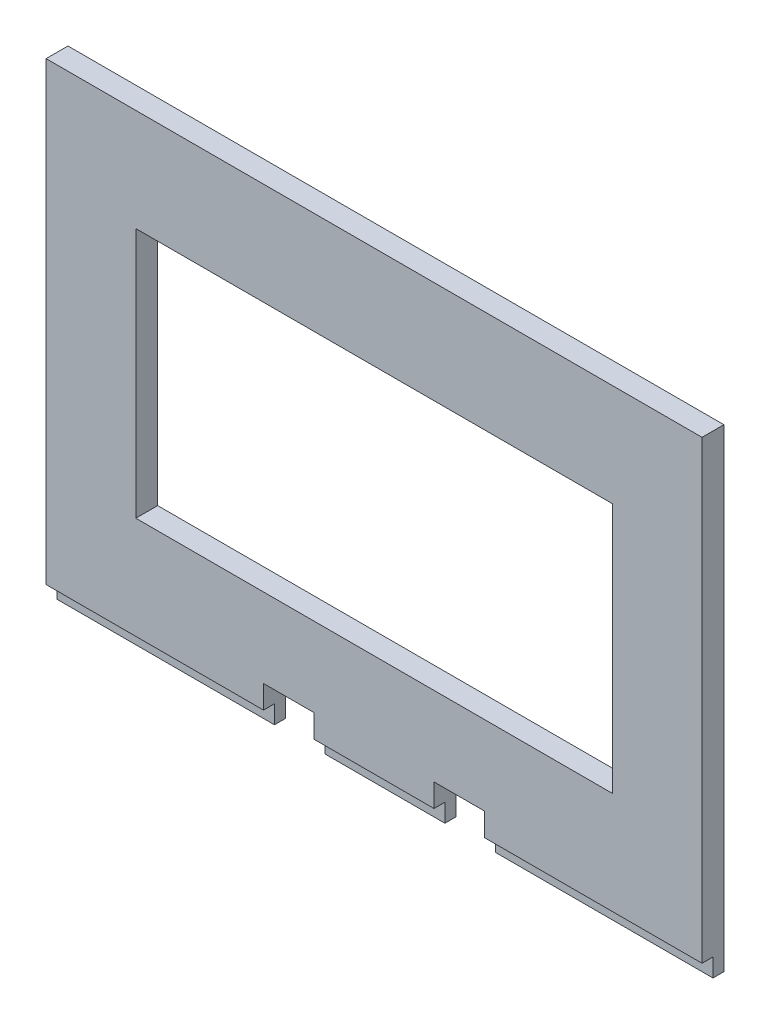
ISO-10303-21;
HEADER;
FILE_DESCRIPTION(('STEP AP214'),'2;1');
FILE_NAME('part.step','',(''),(''),'','','');
FILE_SCHEMA(('AUTOMOTIVE_DESIGN { 1 0 10303 214 1 1 1 1 }'));
ENDSEC;
DATA;
#1=APPLICATION_CONTEXT('core data for automotive mechanical design processes');
#2=APPLICATION_PROTOCOL_DEFINITION('international standard','automotive_design',2000,#1);
#3=PRODUCT_CONTEXT('',#1,'mechanical');
#4=PRODUCT('Part','Part','',(#3));
#5=PRODUCT_RELATED_PRODUCT_CATEGORY('part','',(#4));
#6=PRODUCT_DEFINITION_FORMATION('','',#4);
#7=PRODUCT_DEFINITION_CONTEXT('part definition',#1,'design');
#8=PRODUCT_DEFINITION('design','',#6,#7);
#9=PRODUCT_DEFINITION_SHAPE('','',#8);
#10=(LENGTH_UNIT() NAMED_UNIT(*) SI_UNIT(.MILLI.,.METRE.));
#11=(NAMED_UNIT(*) PLANE_ANGLE_UNIT() SI_UNIT($,.RADIAN.));
#12=(NAMED_UNIT(*) SI_UNIT($,.STERADIAN.) SOLID_ANGLE_UNIT());
#13=UNCERTAINTY_MEASURE_WITH_UNIT(LENGTH_MEASURE(1.E-05),#10,'distance_accuracy_value','');
#14=(GEOMETRIC_REPRESENTATION_CONTEXT(3) GLOBAL_UNCERTAINTY_ASSIGNED_CONTEXT((#13)) GLOBAL_UNIT_ASSIGNED_CONTEXT((#10,
#11,#12)) REPRESENTATION_CONTEXT('',''));
#15=CARTESIAN_POINT('',(0.,0.,0.));
#16=DIRECTION('',(0.,0.,1.));
#17=DIRECTION('',(1.,0.,0.));
#18=AXIS2_PLACEMENT_3D('',#15,#16,#17);
#19=CARTESIAN_POINT('',(90.,-62.5,4.));
#20=DIRECTION('',(0.,1.,0.));
#21=DIRECTION('',(-1.,0.,0.));
#22=AXIS2_PLACEMENT_3D('',#19,#20,#21);
#23=PLANE('',#22);
#24=DIRECTION('',(1.,0.,0.));
#25=VECTOR('',#24,1.);
#26=CARTESIAN_POINT('',(-90.,-62.5,6.));
#27=LINE('',#26,#25);
#28=CARTESIAN_POINT('',(-16.4469174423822,-62.5,6.));
#29=VERTEX_POINT('',#28);
#30=CARTESIAN_POINT('',(16.4469174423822,-62.5,6.));
#31=VERTEX_POINT('',#30);
#32=EDGE_CURVE('E371',#29,#31,#27,.T.);
#33=ORIENTED_EDGE('',*,*,#32,.F.);
#34=DIRECTION('',(0.,0.,-1.));
#35=VECTOR('',#34,1.);
#36=CARTESIAN_POINT('',(-16.4469174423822,-62.5,4.));
#37=LINE('',#36,#35);
#38=CARTESIAN_POINT('',(-16.4469174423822,-62.5,3.));
#39=VERTEX_POINT('',#38);
#40=EDGE_CURVE('E311',#29,#39,#37,.T.);
#41=ORIENTED_EDGE('',*,*,#40,.T.);
#42=DIRECTION('',(-1.,0.,0.));
#43=VECTOR('',#42,1.);
#44=CARTESIAN_POINT('',(90.,-62.5,3.));
#45=LINE('',#44,#43);
#46=CARTESIAN_POINT('',(16.4469174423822,-62.5,3.));
#47=VERTEX_POINT('',#46);
#48=EDGE_CURVE('E226',#47,#39,#45,.T.);
#49=ORIENTED_EDGE('',*,*,#48,.F.);
#50=DIRECTION('',(0.,0.,1.));
#51=VECTOR('',#50,1.);
#52=CARTESIAN_POINT('',(16.4469174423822,-62.5,4.));
#53=LINE('',#52,#51);
#54=EDGE_CURVE('E293',#47,#31,#53,.T.);
#55=ORIENTED_EDGE('',*,*,#54,.T.);
#56=EDGE_LOOP('',(#33,#41,#49,#55));
#57=FACE_BOUND('',#56,.T.);
#58=ADVANCED_FACE('F41',(#57),#23,.F.);
#59=CARTESIAN_POINT('',(90.,-67.5,3.));
#60=DIRECTION('',(0.,0.,-1.));
#61=DIRECTION('',(-1.,0.,0.));
#62=AXIS2_PLACEMENT_3D('',#59,#60,#61);
#63=PLANE('',#62);
#64=ORIENTED_EDGE('',*,*,#48,.T.);
#65=DIRECTION('',(0.,-1.,0.));
#66=VECTOR('',#65,1.);
#67=CARTESIAN_POINT('',(-16.4469174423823,-67.4999999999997,3.));
#68=LINE('',#67,#66);
#69=CARTESIAN_POINT('',(-16.4469174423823,-67.5,3.));
#70=VERTEX_POINT('',#69);
#71=EDGE_CURVE('E314',#39,#70,#68,.T.);
#72=ORIENTED_EDGE('',*,*,#71,.T.);
#73=DIRECTION('',(-1.,0.,0.));
#74=VECTOR('',#73,1.);
#75=CARTESIAN_POINT('',(90.,-67.5,3.));
#76=LINE('',#75,#74);
#77=CARTESIAN_POINT('',(16.4469174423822,-67.5,3.));
#78=VERTEX_POINT('',#77);
#79=EDGE_CURVE('E341',#78,#70,#76,.T.);
#80=ORIENTED_EDGE('',*,*,#79,.F.);
#81=DIRECTION('',(0.,1.,0.));
#82=VECTOR('',#81,1.);
#83=CARTESIAN_POINT('',(16.4469174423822,-67.5,3.));
#84=LINE('',#83,#82);
#85=EDGE_CURVE('E64',#78,#47,#84,.T.);
#86=ORIENTED_EDGE('',*,*,#85,.T.);
#87=EDGE_LOOP('',(#64,#72,#80,#86));
#88=FACE_BOUND('',#87,.T.);
#89=ADVANCED_FACE('F421',(#88),#63,.F.);
#90=CARTESIAN_POINT('',(0.,-67.5,0.));
#91=DIRECTION('',(0.,-1.,0.));
#92=DIRECTION('',(1.,0.,0.));
#93=AXIS2_PLACEMENT_3D('',#90,#91,#92);
#94=PLANE('',#93);
#95=DIRECTION('',(0.,0.,1.));
#96=VECTOR('',#95,1.);
#97=CARTESIAN_POINT('',(-16.4469174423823,-67.5,0.));
#98=LINE('',#97,#96);
#99=CARTESIAN_POINT('',(-16.4469174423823,-67.5,0.));
#100=VERTEX_POINT('',#99);
#101=EDGE_CURVE('E49',#100,#70,#98,.T.);
#102=ORIENTED_EDGE('',*,*,#101,.F.);
#103=DIRECTION('',(1.,0.,0.));
#104=VECTOR('',#103,1.);
#105=CARTESIAN_POINT('',(90.,-67.5,0.));
#106=LINE('',#105,#104);
#107=CARTESIAN_POINT('',(16.4469174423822,-67.5,0.));
#108=VERTEX_POINT('',#107);
#109=EDGE_CURVE('E214',#100,#108,#106,.T.);
#110=ORIENTED_EDGE('',*,*,#109,.T.);
#111=DIRECTION('',(0.,0.,-1.));
#112=VECTOR('',#111,1.);
#113=CARTESIAN_POINT('',(16.4469174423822,-67.5,0.));
#114=LINE('',#113,#112);
#115=EDGE_CURVE('E346',#78,#108,#114,.T.);
#116=ORIENTED_EDGE('',*,*,#115,.F.);
#117=ORIENTED_EDGE('',*,*,#79,.T.);
#118=EDGE_LOOP('',(#102,#110,#116,#117));
#119=FACE_BOUND('',#118,.T.);
#120=ADVANCED_FACE('F339',(#119),#94,.T.);
#121=CARTESIAN_POINT('',(30.3326113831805,-62.5,6.));
#122=VERTEX_POINT('',#121);
#123=CARTESIAN_POINT('',(90.,-62.5,6.));
#124=VERTEX_POINT('',#123);
#125=EDGE_CURVE('E372',#122,#124,#27,.T.);
#126=ORIENTED_EDGE('',*,*,#125,.F.);
#127=DIRECTION('',(0.,0.,-1.));
#128=VECTOR('',#127,1.);
#129=CARTESIAN_POINT('',(30.3326113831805,-62.5,4.));
#130=LINE('',#129,#128);
#131=CARTESIAN_POINT('',(30.3326113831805,-62.5,3.));
#132=VERTEX_POINT('',#131);
#133=EDGE_CURVE('E285',#122,#132,#130,.T.);
#134=ORIENTED_EDGE('',*,*,#133,.T.);
#135=CARTESIAN_POINT('',(90.,-62.5,3.));
#136=VERTEX_POINT('',#135);
#137=EDGE_CURVE('E220',#136,#132,#45,.T.);
#138=ORIENTED_EDGE('',*,*,#137,.F.);
#139=DIRECTION('',(0.,0.,-1.));
#140=VECTOR('',#139,1.);
#141=CARTESIAN_POINT('',(90.,-62.5,4.));
#142=LINE('',#141,#140);
#143=EDGE_CURVE('E350',#124,#136,#142,.T.);
#144=ORIENTED_EDGE('',*,*,#143,.F.);
#145=EDGE_LOOP('',(#126,#134,#138,#144));
#146=FACE_BOUND('',#145,.T.);
#147=ADVANCED_FACE('F406',(#146),#23,.F.);
#148=ORIENTED_EDGE('',*,*,#137,.T.);
#149=DIRECTION('',(0.,-1.,0.));
#150=VECTOR('',#149,1.);
#151=CARTESIAN_POINT('',(30.3326113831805,-67.5,3.));
#152=LINE('',#151,#150);
#153=CARTESIAN_POINT('',(30.3326113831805,-67.5,3.));
#154=VERTEX_POINT('',#153);
#155=EDGE_CURVE('E288',#132,#154,#152,.T.);
#156=ORIENTED_EDGE('',*,*,#155,.T.);
#157=CARTESIAN_POINT('',(90.,-67.5,3.));
#158=VERTEX_POINT('',#157);
#159=EDGE_CURVE('E383',#158,#154,#76,.T.);
#160=ORIENTED_EDGE('',*,*,#159,.F.);
#161=DIRECTION('',(0.,1.,0.));
#162=VECTOR('',#161,1.);
#163=CARTESIAN_POINT('',(90.,-67.5,3.));
#164=LINE('',#163,#162);
#165=EDGE_CURVE('E379',#158,#136,#164,.T.);
#166=ORIENTED_EDGE('',*,*,#165,.T.);
#167=EDGE_LOOP('',(#148,#156,#160,#166));
#168=FACE_BOUND('',#167,.T.);
#169=ADVANCED_FACE('F408',(#168),#63,.F.);
#170=DIRECTION('',(0.,0.,1.));
#171=VECTOR('',#170,1.);
#172=CARTESIAN_POINT('',(30.3326113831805,-67.5,0.));
#173=LINE('',#172,#171);
#174=CARTESIAN_POINT('',(30.3326113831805,-67.5,0.));
#175=VERTEX_POINT('',#174);
#176=EDGE_CURVE('E344',#175,#154,#173,.T.);
#177=ORIENTED_EDGE('',*,*,#176,.F.);
#178=CARTESIAN_POINT('',(90.,-67.5,0.));
#179=VERTEX_POINT('',#178);
#180=EDGE_CURVE('E216',#175,#179,#106,.T.);
#181=ORIENTED_EDGE('',*,*,#180,.T.);
#182=DIRECTION('',(0.,0.,1.));
#183=VECTOR('',#182,1.);
#184=CARTESIAN_POINT('',(90.,-67.5,0.));
#185=LINE('',#184,#183);
#186=EDGE_CURVE('E213',#179,#158,#185,.T.);
#187=ORIENTED_EDGE('',*,*,#186,.T.);
#188=ORIENTED_EDGE('',*,*,#159,.T.);
#189=EDGE_LOOP('',(#177,#181,#187,#188));
#190=FACE_BOUND('',#189,.T.);
#191=ADVANCED_FACE('F412',(#190),#94,.T.);
#192=CARTESIAN_POINT('',(-30.3326113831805,-62.5,3.));
#193=VERTEX_POINT('',#192);
#194=CARTESIAN_POINT('',(-90.,-62.5,3.));
#195=VERTEX_POINT('',#194);
#196=EDGE_CURVE('E228',#193,#195,#45,.T.);
#197=ORIENTED_EDGE('',*,*,#196,.F.);
#198=DIRECTION('',(0.,0.,1.));
#199=VECTOR('',#198,1.);
#200=CARTESIAN_POINT('',(-30.3326113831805,-62.5,4.));
#201=LINE('',#200,#199);
#202=CARTESIAN_POINT('',(-30.3326113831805,-62.5,6.));
#203=VERTEX_POINT('',#202);
#204=EDGE_CURVE('E319',#193,#203,#201,.T.);
#205=ORIENTED_EDGE('',*,*,#204,.T.);
#206=CARTESIAN_POINT('',(-90.,-62.5,6.));
#207=VERTEX_POINT('',#206);
#208=EDGE_CURVE('E368',#207,#203,#27,.T.);
#209=ORIENTED_EDGE('',*,*,#208,.F.);
#210=DIRECTION('',(0.,0.,-1.));
#211=VECTOR('',#210,1.);
#212=CARTESIAN_POINT('',(-90.,-62.5,4.));
#213=LINE('',#212,#211);
#214=EDGE_CURVE('E348',#207,#195,#213,.T.);
#215=ORIENTED_EDGE('',*,*,#214,.T.);
#216=EDGE_LOOP('',(#197,#205,#209,#215));
#217=FACE_BOUND('',#216,.T.);
#218=ADVANCED_FACE('F428',(#217),#23,.F.);
#219=CARTESIAN_POINT('',(-90.,-62.5,4.));
#220=DIRECTION('',(1.,0.,0.));
#221=DIRECTION('',(0.,0.,-1.));
#222=AXIS2_PLACEMENT_3D('',#219,#220,#221);
#223=PLANE('',#222);
#224=DIRECTION('',(0.,-1.,0.));
#225=VECTOR('',#224,1.);
#226=CARTESIAN_POINT('',(-90.,-62.5,0.));
#227=LINE('',#226,#225);
#228=CARTESIAN_POINT('',(-90.,62.5,0.));
#229=VERTEX_POINT('',#228);
#230=CARTESIAN_POINT('',(-90.,-67.5,0.));
#231=VERTEX_POINT('',#230);
#232=EDGE_CURVE('E363',#229,#231,#227,.T.);
#233=ORIENTED_EDGE('',*,*,#232,.T.);
#234=DIRECTION('',(0.,0.,-1.));
#235=VECTOR('',#234,1.);
#236=CARTESIAN_POINT('',(-90.,-67.5,3.));
#237=LINE('',#236,#235);
#238=CARTESIAN_POINT('',(-90.,-67.5,3.));
#239=VERTEX_POINT('',#238);
#240=EDGE_CURVE('E212',#239,#231,#237,.T.);
#241=ORIENTED_EDGE('',*,*,#240,.F.);
#242=DIRECTION('',(0.,1.,0.));
#243=VECTOR('',#242,1.);
#244=CARTESIAN_POINT('',(-90.,-67.5,3.));
#245=LINE('',#244,#243);
#246=EDGE_CURVE('E380',#239,#195,#245,.T.);
#247=ORIENTED_EDGE('',*,*,#246,.T.);
#248=ORIENTED_EDGE('',*,*,#214,.F.);
#249=DIRECTION('',(0.,-1.,0.));
#250=VECTOR('',#249,1.);
#251=CARTESIAN_POINT('',(-90.,62.5,6.));
#252=LINE('',#251,#250);
#253=CARTESIAN_POINT('',(-90.,62.5,6.));
#254=VERTEX_POINT('',#253);
#255=EDGE_CURVE('E373',#254,#207,#252,.T.);
#256=ORIENTED_EDGE('',*,*,#255,.F.);
#257=DIRECTION('',(0.,0.,-1.));
#258=VECTOR('',#257,1.);
#259=CARTESIAN_POINT('',(-90.,62.5,4.));
#260=LINE('',#259,#258);
#261=EDGE_CURVE('E356',#254,#229,#260,.T.);
#262=ORIENTED_EDGE('',*,*,#261,.T.);
#263=EDGE_LOOP('',(#233,#241,#247,#248,#256,#262));
#264=FACE_BOUND('',#263,.T.);
#265=ADVANCED_FACE('F43',(#264),#223,.F.);
#266=CARTESIAN_POINT('',(90.,-62.5,4.));
#267=DIRECTION('',(-1.,0.,0.));
#268=DIRECTION('',(0.,0.,1.));
#269=AXIS2_PLACEMENT_3D('',#266,#267,#268);
#270=PLANE('',#269);
#271=DIRECTION('',(0.,1.,0.));
#272=VECTOR('',#271,1.);
#273=CARTESIAN_POINT('',(90.,-62.5,0.));
#274=LINE('',#273,#272);
#275=CARTESIAN_POINT('',(90.,62.5,0.));
#276=VERTEX_POINT('',#275);
#277=EDGE_CURVE('E361',#179,#276,#274,.T.);
#278=ORIENTED_EDGE('',*,*,#277,.T.);
#279=DIRECTION('',(0.,0.,-1.));
#280=VECTOR('',#279,1.);
#281=CARTESIAN_POINT('',(90.,62.5,4.));
#282=LINE('',#281,#280);
#283=CARTESIAN_POINT('',(90.,62.5,6.));
#284=VERTEX_POINT('',#283);
#285=EDGE_CURVE('E353',#284,#276,#282,.T.);
#286=ORIENTED_EDGE('',*,*,#285,.F.);
#287=DIRECTION('',(0.,1.,0.));
#288=VECTOR('',#287,1.);
#289=CARTESIAN_POINT('',(90.,-62.5,6.));
#290=LINE('',#289,#288);
#291=EDGE_CURVE('E365',#124,#284,#290,.T.);
#292=ORIENTED_EDGE('',*,*,#291,.F.);
#293=ORIENTED_EDGE('',*,*,#143,.T.);
#294=ORIENTED_EDGE('',*,*,#165,.F.);
#295=ORIENTED_EDGE('',*,*,#186,.F.);
#296=EDGE_LOOP('',(#278,#286,#292,#293,#294,#295));
#297=FACE_BOUND('',#296,.T.);
#298=ADVANCED_FACE('F396',(#297),#270,.F.);
#299=CARTESIAN_POINT('',(90.,62.5,4.));
#300=DIRECTION('',(0.,-1.,0.));
#301=DIRECTION('',(1.,0.,0.));
#302=AXIS2_PLACEMENT_3D('',#299,#300,#301);
#303=PLANE('',#302);
#304=DIRECTION('',(-1.,0.,0.));
#305=VECTOR('',#304,1.);
#306=CARTESIAN_POINT('',(90.,62.5,0.));
#307=LINE('',#306,#305);
#308=EDGE_CURVE('E359',#276,#229,#307,.T.);
#309=ORIENTED_EDGE('',*,*,#308,.T.);
#310=ORIENTED_EDGE('',*,*,#261,.F.);
#311=DIRECTION('',(-1.,0.,0.));
#312=VECTOR('',#311,1.);
#313=CARTESIAN_POINT('',(90.,62.5,6.));
#314=LINE('',#313,#312);
#315=EDGE_CURVE('E376',#284,#254,#314,.T.);
#316=ORIENTED_EDGE('',*,*,#315,.F.);
#317=ORIENTED_EDGE('',*,*,#285,.T.);
#318=EDGE_LOOP('',(#309,#310,#316,#317));
#319=FACE_BOUND('',#318,.T.);
#320=ADVANCED_FACE('F392',(#319),#303,.F.);
#321=CARTESIAN_POINT('',(0.,0.,0.));
#322=DIRECTION('',(0.,0.,1.));
#323=DIRECTION('',(1.,0.,0.));
#324=AXIS2_PLACEMENT_3D('',#321,#322,#323);
#325=PLANE('',#324);
#326=DIRECTION('',(-1.,0.,0.));
#327=VECTOR('',#326,1.);
#328=CARTESIAN_POINT('',(65.3846882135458,34.420905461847,0.));
#329=LINE('',#328,#327);
#330=CARTESIAN_POINT('',(65.3846882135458,34.420905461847,0.));
#331=VERTEX_POINT('',#330);
#332=CARTESIAN_POINT('',(-65.3846882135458,34.420905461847,0.));
#333=VERTEX_POINT('',#332);
#334=EDGE_CURVE('E253',#331,#333,#329,.T.);
#335=ORIENTED_EDGE('',*,*,#334,.T.);
#336=DIRECTION('',(0.,-1.,0.));
#337=VECTOR('',#336,1.);
#338=CARTESIAN_POINT('',(-65.3846882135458,-34.420905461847,0.));
#339=LINE('',#338,#337);
#340=CARTESIAN_POINT('',(-65.3846882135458,-34.420905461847,0.));
#341=VERTEX_POINT('',#340);
#342=EDGE_CURVE('E278',#333,#341,#339,.T.);
#343=ORIENTED_EDGE('',*,*,#342,.T.);
#344=DIRECTION('',(1.,0.,0.));
#345=VECTOR('',#344,1.);
#346=CARTESIAN_POINT('',(65.3846882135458,-34.420905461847,0.));
#347=LINE('',#346,#345);
#348=CARTESIAN_POINT('',(65.3846882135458,-34.420905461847,0.));
#349=VERTEX_POINT('',#348);
#350=EDGE_CURVE('E265',#341,#349,#347,.T.);
#351=ORIENTED_EDGE('',*,*,#350,.T.);
#352=DIRECTION('',(0.,1.,0.));
#353=VECTOR('',#352,1.);
#354=CARTESIAN_POINT('',(65.3846882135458,-34.420905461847,0.));
#355=LINE('',#354,#353);
#356=EDGE_CURVE('E259',#349,#331,#355,.T.);
#357=ORIENTED_EDGE('',*,*,#356,.T.);
#358=EDGE_LOOP('',(#335,#343,#351,#357));
#359=FACE_BOUND('',#358,.T.);
#360=ORIENTED_EDGE('',*,*,#109,.F.);
#361=DIRECTION('',(0.,-1.,0.));
#362=VECTOR('',#361,1.);
#363=CARTESIAN_POINT('',(-16.4469174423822,-56.1709993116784,0.));
#364=LINE('',#363,#362);
#365=CARTESIAN_POINT('',(-16.4469174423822,-56.1709993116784,0.));
#366=VERTEX_POINT('',#365);
#367=EDGE_CURVE('E326',#366,#100,#364,.T.);
#368=ORIENTED_EDGE('',*,*,#367,.F.);
#369=DIRECTION('',(1.,0.,0.));
#370=VECTOR('',#369,1.);
#371=CARTESIAN_POINT('',(-30.3326113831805,-56.1709993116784,0.));
#372=LINE('',#371,#370);
#373=CARTESIAN_POINT('',(-30.3326113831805,-56.1709993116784,0.));
#374=VERTEX_POINT('',#373);
#375=EDGE_CURVE('E207',#374,#366,#372,.T.);
#376=ORIENTED_EDGE('',*,*,#375,.F.);
#377=DIRECTION('',(0.,1.,0.));
#378=VECTOR('',#377,1.);
#379=CARTESIAN_POINT('',(-30.3326113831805,-67.5,0.));
#380=LINE('',#379,#378);
#381=CARTESIAN_POINT('',(-30.3326113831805,-67.5,0.));
#382=VERTEX_POINT('',#381);
#383=EDGE_CURVE('E192',#382,#374,#380,.T.);
#384=ORIENTED_EDGE('',*,*,#383,.F.);
#385=EDGE_CURVE('E204',#231,#382,#106,.T.);
#386=ORIENTED_EDGE('',*,*,#385,.F.);
#387=ORIENTED_EDGE('',*,*,#232,.F.);
#388=ORIENTED_EDGE('',*,*,#308,.F.);
#389=ORIENTED_EDGE('',*,*,#277,.F.);
#390=ORIENTED_EDGE('',*,*,#180,.F.);
#391=DIRECTION('',(0.,-1.,0.));
#392=VECTOR('',#391,1.);
#393=CARTESIAN_POINT('',(30.3326113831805,-67.5,0.));
#394=LINE('',#393,#392);
#395=CARTESIAN_POINT('',(30.3326113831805,-56.1709993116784,0.));
#396=VERTEX_POINT('',#395);
#397=EDGE_CURVE('E300',#396,#175,#394,.T.);
#398=ORIENTED_EDGE('',*,*,#397,.F.);
#399=DIRECTION('',(1.,0.,0.));
#400=VECTOR('',#399,1.);
#401=CARTESIAN_POINT('',(30.3326113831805,-56.1709993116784,0.));
#402=LINE('',#401,#400);
#403=CARTESIAN_POINT('',(16.4469174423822,-56.1709993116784,0.));
#404=VERTEX_POINT('',#403);
#405=EDGE_CURVE('E303',#404,#396,#402,.T.);
#406=ORIENTED_EDGE('',*,*,#405,.F.);
#407=DIRECTION('',(0.,1.,0.));
#408=VECTOR('',#407,1.);
#409=CARTESIAN_POINT('',(16.4469174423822,-56.1709993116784,0.));
#410=LINE('',#409,#408);
#411=EDGE_CURVE('E306',#108,#404,#410,.T.);
#412=ORIENTED_EDGE('',*,*,#411,.F.);
#413=EDGE_LOOP('',(#360,#368,#376,#384,#386,#387,#388,#389,#390,#398,#406,#412));
#414=FACE_BOUND('',#413,.T.);
#415=ADVANCED_FACE('F202',(#359,#414),#325,.F.);
#416=CARTESIAN_POINT('',(0.,0.,6.));
#417=DIRECTION('',(0.,0.,1.));
#418=DIRECTION('',(1.,0.,0.));
#419=AXIS2_PLACEMENT_3D('',#416,#417,#418);
#420=PLANE('',#419);
#421=DIRECTION('',(0.,1.,0.));
#422=VECTOR('',#421,1.);
#423=CARTESIAN_POINT('',(-16.4469174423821,0.,6.));
#424=LINE('',#423,#422);
#425=CARTESIAN_POINT('',(-16.4469174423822,-56.1709993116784,6.));
#426=VERTEX_POINT('',#425);
#427=EDGE_CURVE('E309',#29,#426,#424,.T.);
#428=ORIENTED_EDGE('',*,*,#427,.F.);
#429=ORIENTED_EDGE('',*,*,#32,.T.);
#430=DIRECTION('',(0.,-1.,0.));
#431=VECTOR('',#430,1.);
#432=CARTESIAN_POINT('',(16.4469174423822,0.,6.));
#433=LINE('',#432,#431);
#434=CARTESIAN_POINT('',(16.4469174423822,-56.1709993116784,6.));
#435=VERTEX_POINT('',#434);
#436=EDGE_CURVE('E290',#435,#31,#433,.T.);
#437=ORIENTED_EDGE('',*,*,#436,.F.);
#438=DIRECTION('',(-1.,0.,0.));
#439=VECTOR('',#438,1.);
#440=CARTESIAN_POINT('',(0.,-56.1709993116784,6.));
#441=LINE('',#440,#439);
#442=CARTESIAN_POINT('',(30.3326113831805,-56.1709993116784,6.));
#443=VERTEX_POINT('',#442);
#444=EDGE_CURVE('E197',#443,#435,#441,.T.);
#445=ORIENTED_EDGE('',*,*,#444,.F.);
#446=DIRECTION('',(0.,1.,0.));
#447=VECTOR('',#446,1.);
#448=CARTESIAN_POINT('',(30.3326113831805,0.,6.));
#449=LINE('',#448,#447);
#450=EDGE_CURVE('E272',#122,#443,#449,.T.);
#451=ORIENTED_EDGE('',*,*,#450,.F.);
#452=ORIENTED_EDGE('',*,*,#125,.T.);
#453=ORIENTED_EDGE('',*,*,#291,.T.);
#454=ORIENTED_EDGE('',*,*,#315,.T.);
#455=ORIENTED_EDGE('',*,*,#255,.T.);
#456=ORIENTED_EDGE('',*,*,#208,.T.);
#457=DIRECTION('',(0.,-1.,0.));
#458=VECTOR('',#457,1.);
#459=CARTESIAN_POINT('',(-30.3326113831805,0.,6.));
#460=LINE('',#459,#458);
#461=CARTESIAN_POINT('',(-30.3326113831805,-56.1709993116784,6.));
#462=VERTEX_POINT('',#461);
#463=EDGE_CURVE('E317',#462,#203,#460,.T.);
#464=ORIENTED_EDGE('',*,*,#463,.F.);
#465=DIRECTION('',(-1.,0.,0.));
#466=VECTOR('',#465,1.);
#467=CARTESIAN_POINT('',(0.,-56.1709993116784,6.));
#468=LINE('',#467,#466);
#469=EDGE_CURVE('E11',#426,#462,#468,.T.);
#470=ORIENTED_EDGE('',*,*,#469,.F.);
#471=EDGE_LOOP('',(#428,#429,#437,#445,#451,#452,#453,#454,#455,#456,#464,#470));
#472=FACE_BOUND('',#471,.T.);
#473=DIRECTION('',(0.,-1.,0.));
#474=VECTOR('',#473,1.);
#475=CARTESIAN_POINT('',(-65.3846882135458,-34.420905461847,6.));
#476=LINE('',#475,#474);
#477=CARTESIAN_POINT('',(-65.3846882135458,34.420905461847,6.));
#478=VERTEX_POINT('',#477);
#479=CARTESIAN_POINT('',(-65.3846882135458,-34.420905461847,6.));
#480=VERTEX_POINT('',#479);
#481=EDGE_CURVE('E269',#478,#480,#476,.T.);
#482=ORIENTED_EDGE('',*,*,#481,.F.);
#483=DIRECTION('',(-1.,0.,0.));
#484=VECTOR('',#483,1.);
#485=CARTESIAN_POINT('',(65.3846882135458,34.420905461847,6.));
#486=LINE('',#485,#484);
#487=CARTESIAN_POINT('',(65.3846882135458,34.420905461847,6.));
#488=VERTEX_POINT('',#487);
#489=EDGE_CURVE('E248',#488,#478,#486,.T.);
#490=ORIENTED_EDGE('',*,*,#489,.F.);
#491=DIRECTION('',(0.,1.,0.));
#492=VECTOR('',#491,1.);
#493=CARTESIAN_POINT('',(65.3846882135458,-34.420905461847,6.));
#494=LINE('',#493,#492);
#495=CARTESIAN_POINT('',(65.3846882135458,-34.420905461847,6.));
#496=VERTEX_POINT('',#495);
#497=EDGE_CURVE('E273',#496,#488,#494,.T.);
#498=ORIENTED_EDGE('',*,*,#497,.F.);
#499=DIRECTION('',(1.,0.,0.));
#500=VECTOR('',#499,1.);
#501=CARTESIAN_POINT('',(65.3846882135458,-34.420905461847,6.));
#502=LINE('',#501,#500);
#503=EDGE_CURVE('E271',#480,#496,#502,.T.);
#504=ORIENTED_EDGE('',*,*,#503,.F.);
#505=EDGE_LOOP('',(#482,#490,#498,#504));
#506=FACE_BOUND('',#505,.T.);
#507=ADVANCED_FACE('F399',(#472,#506),#420,.T.);
#508=CARTESIAN_POINT('',(-30.3326113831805,-67.5,3.));
#509=VERTEX_POINT('',#508);
#510=EDGE_CURVE('E217',#509,#239,#76,.T.);
#511=ORIENTED_EDGE('',*,*,#510,.F.);
#512=DIRECTION('',(0.,1.,0.));
#513=VECTOR('',#512,1.);
#514=CARTESIAN_POINT('',(-30.3326113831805,-67.5,3.));
#515=LINE('',#514,#513);
#516=EDGE_CURVE('E56',#509,#193,#515,.T.);
#517=ORIENTED_EDGE('',*,*,#516,.T.);
#518=ORIENTED_EDGE('',*,*,#196,.T.);
#519=ORIENTED_EDGE('',*,*,#246,.F.);
#520=EDGE_LOOP('',(#511,#517,#518,#519));
#521=FACE_BOUND('',#520,.T.);
#522=ADVANCED_FACE('F387',(#521),#63,.F.);
#523=DIRECTION('',(0.,0.,-1.));
#524=VECTOR('',#523,1.);
#525=CARTESIAN_POINT('',(-30.3326113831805,-67.5,0.));
#526=LINE('',#525,#524);
#527=EDGE_CURVE('E188',#509,#382,#526,.T.);
#528=ORIENTED_EDGE('',*,*,#527,.F.);
#529=ORIENTED_EDGE('',*,*,#510,.T.);
#530=ORIENTED_EDGE('',*,*,#240,.T.);
#531=ORIENTED_EDGE('',*,*,#385,.T.);
#532=EDGE_LOOP('',(#528,#529,#530,#531));
#533=FACE_BOUND('',#532,.T.);
#534=ADVANCED_FACE('F210',(#533),#94,.T.);
#535=CARTESIAN_POINT('',(-65.3846882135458,-34.420905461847,0.));
#536=DIRECTION('',(-1.,0.,0.));
#537=DIRECTION('',(0.,0.,1.));
#538=AXIS2_PLACEMENT_3D('',#535,#536,#537);
#539=PLANE('',#538);
#540=ORIENTED_EDGE('',*,*,#481,.T.);
#541=DIRECTION('',(0.,0.,1.));
#542=VECTOR('',#541,1.);
#543=CARTESIAN_POINT('',(-65.3846882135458,-34.420905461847,0.));
#544=LINE('',#543,#542);
#545=EDGE_CURVE('E251',#341,#480,#544,.T.);
#546=ORIENTED_EDGE('',*,*,#545,.F.);
#547=ORIENTED_EDGE('',*,*,#342,.F.);
#548=DIRECTION('',(0.,0.,1.));
#549=VECTOR('',#548,1.);
#550=CARTESIAN_POINT('',(-65.3846882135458,34.420905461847,0.));
#551=LINE('',#550,#549);
#552=EDGE_CURVE('E235',#333,#478,#551,.T.);
#553=ORIENTED_EDGE('',*,*,#552,.T.);
#554=EDGE_LOOP('',(#540,#546,#547,#553));
#555=FACE_BOUND('',#554,.T.);
#556=ADVANCED_FACE('F450',(#555),#539,.F.);
#557=CARTESIAN_POINT('',(65.3846882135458,34.420905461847,0.));
#558=DIRECTION('',(0.,1.,0.));
#559=DIRECTION('',(0.,0.,1.));
#560=AXIS2_PLACEMENT_3D('',#557,#558,#559);
#561=PLANE('',#560);
#562=ORIENTED_EDGE('',*,*,#489,.T.);
#563=ORIENTED_EDGE('',*,*,#552,.F.);
#564=ORIENTED_EDGE('',*,*,#334,.F.);
#565=DIRECTION('',(0.,0.,1.));
#566=VECTOR('',#565,1.);
#567=CARTESIAN_POINT('',(65.3846882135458,34.420905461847,0.));
#568=LINE('',#567,#566);
#569=EDGE_CURVE('E240',#331,#488,#568,.T.);
#570=ORIENTED_EDGE('',*,*,#569,.T.);
#571=EDGE_LOOP('',(#562,#563,#564,#570));
#572=FACE_BOUND('',#571,.T.);
#573=ADVANCED_FACE('F456',(#572),#561,.F.);
#574=CARTESIAN_POINT('',(65.3846882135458,-34.420905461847,0.));
#575=DIRECTION('',(1.,0.,0.));
#576=DIRECTION('',(0.,0.,-1.));
#577=AXIS2_PLACEMENT_3D('',#574,#575,#576);
#578=PLANE('',#577);
#579=ORIENTED_EDGE('',*,*,#497,.T.);
#580=ORIENTED_EDGE('',*,*,#569,.F.);
#581=ORIENTED_EDGE('',*,*,#356,.F.);
#582=DIRECTION('',(0.,0.,1.));
#583=VECTOR('',#582,1.);
#584=CARTESIAN_POINT('',(65.3846882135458,-34.420905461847,0.));
#585=LINE('',#584,#583);
#586=EDGE_CURVE('E245',#349,#496,#585,.T.);
#587=ORIENTED_EDGE('',*,*,#586,.T.);
#588=EDGE_LOOP('',(#579,#580,#581,#587));
#589=FACE_BOUND('',#588,.T.);
#590=ADVANCED_FACE('F482',(#589),#578,.F.);
#591=CARTESIAN_POINT('',(65.3846882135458,-34.420905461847,0.));
#592=DIRECTION('',(0.,-1.,0.));
#593=DIRECTION('',(0.,0.,-1.));
#594=AXIS2_PLACEMENT_3D('',#591,#592,#593);
#595=PLANE('',#594);
#596=ORIENTED_EDGE('',*,*,#503,.T.);
#597=ORIENTED_EDGE('',*,*,#586,.F.);
#598=ORIENTED_EDGE('',*,*,#350,.F.);
#599=ORIENTED_EDGE('',*,*,#545,.T.);
#600=EDGE_LOOP('',(#596,#597,#598,#599));
#601=FACE_BOUND('',#600,.T.);
#602=ADVANCED_FACE('F489',(#601),#595,.F.);
#603=CARTESIAN_POINT('',(30.3326113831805,-67.5,10.));
#604=DIRECTION('',(1.,0.,0.));
#605=DIRECTION('',(0.,0.,-1.));
#606=AXIS2_PLACEMENT_3D('',#603,#604,#605);
#607=PLANE('',#606);
#608=ORIENTED_EDGE('',*,*,#450,.T.);
#609=DIRECTION('',(0.,0.,-1.));
#610=VECTOR('',#609,1.);
#611=CARTESIAN_POINT('',(30.3326113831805,-56.1709993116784,10.));
#612=LINE('',#611,#610);
#613=EDGE_CURVE('E297',#443,#396,#612,.T.);
#614=ORIENTED_EDGE('',*,*,#613,.T.);
#615=ORIENTED_EDGE('',*,*,#397,.T.);
#616=ORIENTED_EDGE('',*,*,#176,.T.);
#617=ORIENTED_EDGE('',*,*,#155,.F.);
#618=ORIENTED_EDGE('',*,*,#133,.F.);
#619=EDGE_LOOP('',(#608,#614,#615,#616,#617,#618));
#620=FACE_BOUND('',#619,.T.);
#621=ADVANCED_FACE('F410',(#620),#607,.F.);
#622=CARTESIAN_POINT('',(30.3326113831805,-56.1709993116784,10.));
#623=DIRECTION('',(0.,1.,0.));
#624=DIRECTION('',(0.,0.,1.));
#625=AXIS2_PLACEMENT_3D('',#622,#623,#624);
#626=PLANE('',#625);
#627=ORIENTED_EDGE('',*,*,#444,.T.);
#628=DIRECTION('',(0.,0.,-1.));
#629=VECTOR('',#628,1.);
#630=CARTESIAN_POINT('',(16.4469174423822,-56.1709993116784,10.));
#631=LINE('',#630,#629);
#632=EDGE_CURVE('E298',#435,#404,#631,.T.);
#633=ORIENTED_EDGE('',*,*,#632,.T.);
#634=ORIENTED_EDGE('',*,*,#405,.T.);
#635=ORIENTED_EDGE('',*,*,#613,.F.);
#636=EDGE_LOOP('',(#627,#633,#634,#635));
#637=FACE_BOUND('',#636,.T.);
#638=ADVANCED_FACE('F416',(#637),#626,.F.);
#639=CARTESIAN_POINT('',(16.4469174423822,-56.1709993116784,10.));
#640=DIRECTION('',(-1.,0.,0.));
#641=DIRECTION('',(0.,0.,1.));
#642=AXIS2_PLACEMENT_3D('',#639,#640,#641);
#643=PLANE('',#642);
#644=ORIENTED_EDGE('',*,*,#436,.T.);
#645=ORIENTED_EDGE('',*,*,#54,.F.);
#646=ORIENTED_EDGE('',*,*,#85,.F.);
#647=ORIENTED_EDGE('',*,*,#115,.T.);
#648=ORIENTED_EDGE('',*,*,#411,.T.);
#649=ORIENTED_EDGE('',*,*,#632,.F.);
#650=EDGE_LOOP('',(#644,#645,#646,#647,#648,#649));
#651=FACE_BOUND('',#650,.T.);
#652=ADVANCED_FACE('F419',(#651),#643,.F.);
#653=CARTESIAN_POINT('',(-16.4469174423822,-56.1709993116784,10.));
#654=DIRECTION('',(1.,0.,0.));
#655=DIRECTION('',(0.,1.,0.));
#656=AXIS2_PLACEMENT_3D('',#653,#654,#655);
#657=PLANE('',#656);
#658=ORIENTED_EDGE('',*,*,#427,.T.);
#659=DIRECTION('',(0.,0.,-1.));
#660=VECTOR('',#659,1.);
#661=CARTESIAN_POINT('',(-16.4469174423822,-56.1709993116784,10.));
#662=LINE('',#661,#660);
#663=EDGE_CURVE('E323',#426,#366,#662,.T.);
#664=ORIENTED_EDGE('',*,*,#663,.T.);
#665=ORIENTED_EDGE('',*,*,#367,.T.);
#666=ORIENTED_EDGE('',*,*,#101,.T.);
#667=ORIENTED_EDGE('',*,*,#71,.F.);
#668=ORIENTED_EDGE('',*,*,#40,.F.);
#669=EDGE_LOOP('',(#658,#664,#665,#666,#667,#668));
#670=FACE_BOUND('',#669,.T.);
#671=ADVANCED_FACE('F336',(#670),#657,.F.);
#672=CARTESIAN_POINT('',(-30.3326113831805,-56.1709993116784,10.));
#673=DIRECTION('',(0.,1.,0.));
#674=DIRECTION('',(0.,0.,1.));
#675=AXIS2_PLACEMENT_3D('',#672,#673,#674);
#676=PLANE('',#675);
#677=ORIENTED_EDGE('',*,*,#469,.T.);
#678=DIRECTION('',(0.,0.,-1.));
#679=VECTOR('',#678,1.);
#680=CARTESIAN_POINT('',(-30.3326113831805,-56.1709993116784,10.));
#681=LINE('',#680,#679);
#682=EDGE_CURVE('E324',#462,#374,#681,.T.);
#683=ORIENTED_EDGE('',*,*,#682,.T.);
#684=ORIENTED_EDGE('',*,*,#375,.T.);
#685=ORIENTED_EDGE('',*,*,#663,.F.);
#686=EDGE_LOOP('',(#677,#683,#684,#685));
#687=FACE_BOUND('',#686,.T.);
#688=ADVANCED_FACE('F331',(#687),#676,.F.);
#689=CARTESIAN_POINT('',(-30.3326113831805,-67.5,10.));
#690=DIRECTION('',(-1.,0.,0.));
#691=DIRECTION('',(0.,0.,1.));
#692=AXIS2_PLACEMENT_3D('',#689,#690,#691);
#693=PLANE('',#692);
#694=ORIENTED_EDGE('',*,*,#463,.T.);
#695=ORIENTED_EDGE('',*,*,#204,.F.);
#696=ORIENTED_EDGE('',*,*,#516,.F.);
#697=ORIENTED_EDGE('',*,*,#527,.T.);
#698=ORIENTED_EDGE('',*,*,#383,.T.);
#699=ORIENTED_EDGE('',*,*,#682,.F.);
#700=EDGE_LOOP('',(#694,#695,#696,#697,#698,#699));
#701=FACE_BOUND('',#700,.T.);
#702=ADVANCED_FACE('F190',(#701),#693,.F.);
#703=CLOSED_SHELL('',(#58,#89,#120,#147,#169,#191,#218,#265,#298,#320,#415,#507,#522,#534,#556,
#573,#590,#602,#621,#638,#652,#671,#688,#702));
#704=MANIFOLD_SOLID_BREP('B2',#703);
#705=ADVANCED_BREP_SHAPE_REPRESENTATION('',(#18,#704),#14);
#706=SHAPE_DEFINITION_REPRESENTATION(#9,#705);
ENDSEC;
END-ISO-10303-21;
